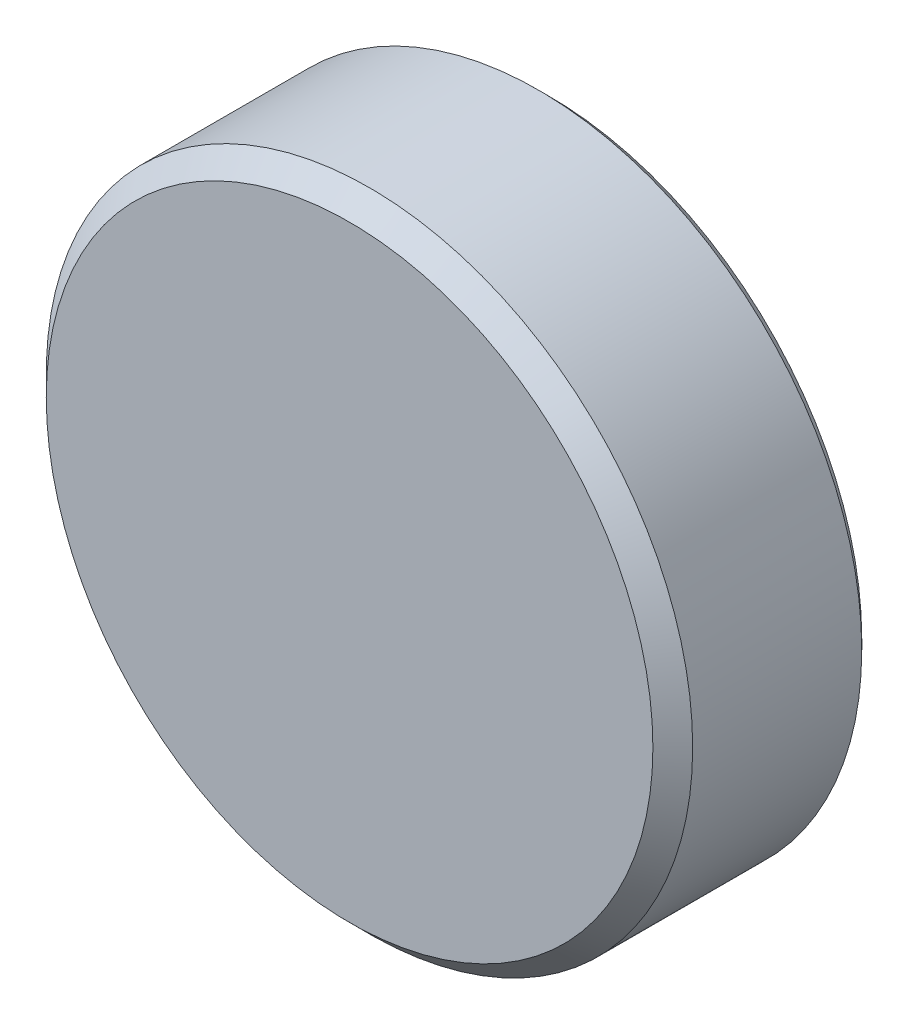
ISO-10303-21;
HEADER;
FILE_DESCRIPTION(('STEP AP214'),'2;1');
FILE_NAME('part.step','',(''),(''),'','','');
FILE_SCHEMA(('AUTOMOTIVE_DESIGN { 1 0 10303 214 1 1 1 1 }'));
ENDSEC;
DATA;
#1=APPLICATION_CONTEXT('core data for automotive mechanical design processes');
#2=APPLICATION_PROTOCOL_DEFINITION('international standard','automotive_design',2000,#1);
#3=PRODUCT_CONTEXT('',#1,'mechanical');
#4=PRODUCT('Part','Part','',(#3));
#5=PRODUCT_RELATED_PRODUCT_CATEGORY('part','',(#4));
#6=PRODUCT_DEFINITION_FORMATION('','',#4);
#7=PRODUCT_DEFINITION_CONTEXT('part definition',#1,'design');
#8=PRODUCT_DEFINITION('design','',#6,#7);
#9=PRODUCT_DEFINITION_SHAPE('','',#8);
#10=(LENGTH_UNIT() NAMED_UNIT(*) SI_UNIT(.MILLI.,.METRE.));
#11=(NAMED_UNIT(*) PLANE_ANGLE_UNIT() SI_UNIT($,.RADIAN.));
#12=(NAMED_UNIT(*) SI_UNIT($,.STERADIAN.) SOLID_ANGLE_UNIT());
#13=UNCERTAINTY_MEASURE_WITH_UNIT(LENGTH_MEASURE(1.E-05),#10,'distance_accuracy_value','');
#14=(GEOMETRIC_REPRESENTATION_CONTEXT(3) GLOBAL_UNCERTAINTY_ASSIGNED_CONTEXT((#13)) GLOBAL_UNIT_ASSIGNED_CONTEXT((#10,
#11,#12)) REPRESENTATION_CONTEXT('',''));
#15=CARTESIAN_POINT('',(0.,0.,0.));
#16=DIRECTION('',(0.,0.,1.));
#17=DIRECTION('',(1.,0.,0.));
#18=AXIS2_PLACEMENT_3D('',#15,#16,#17);
#19=CARTESIAN_POINT('',(0.,0.,25.4));
#20=DIRECTION('',(0.,0.,-1.));
#21=DIRECTION('',(-1.,0.,0.));
#22=AXIS2_PLACEMENT_3D('',#19,#20,#21);
#23=CYLINDRICAL_SURFACE('',#22,41.275);
#24=CARTESIAN_POINT('',(0.,0.,1.26999999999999));
#25=DIRECTION('',(0.,0.,1.));
#26=DIRECTION('',(1.,0.,0.));
#27=AXIS2_PLACEMENT_3D('',#24,#25,#26);
#28=CIRCLE('',#27,41.275);
#29=CARTESIAN_POINT('',(41.275,0.,1.26999999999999));
#30=VERTEX_POINT('',#29);
#31=EDGE_CURVE('E39',#30,#30,#28,.T.);
#32=ORIENTED_EDGE('',*,*,#31,.T.);
#33=EDGE_LOOP('',(#32));
#34=FACE_BOUND('',#33,.T.);
#35=CARTESIAN_POINT('',(0.,0.,22.86));
#36=DIRECTION('',(0.,0.,1.));
#37=DIRECTION('',(1.,0.,0.));
#38=AXIS2_PLACEMENT_3D('',#35,#36,#37);
#39=CIRCLE('',#38,41.275);
#40=CARTESIAN_POINT('',(41.275,0.,22.86));
#41=VERTEX_POINT('',#40);
#42=EDGE_CURVE('E43',#41,#41,#39,.F.);
#43=ORIENTED_EDGE('',*,*,#42,.T.);
#44=EDGE_LOOP('',(#43));
#45=FACE_BOUND('',#44,.T.);
#46=ADVANCED_FACE('F32',(#34,#45),#23,.T.);
#47=CARTESIAN_POINT('',(0.,0.,25.4));
#48=DIRECTION('',(0.,0.,1.));
#49=DIRECTION('',(1.,0.,0.));
#50=AXIS2_PLACEMENT_3D('',#47,#48,#49);
#51=PLANE('',#50);
#52=CARTESIAN_POINT('',(0.,0.,25.4));
#53=DIRECTION('',(0.,0.,1.));
#54=DIRECTION('',(1.,0.,0.));
#55=AXIS2_PLACEMENT_3D('',#52,#53,#54);
#56=CIRCLE('',#55,38.735);
#57=CARTESIAN_POINT('',(38.735,0.,25.4));
#58=VERTEX_POINT('',#57);
#59=EDGE_CURVE('E47',#58,#58,#56,.T.);
#60=ORIENTED_EDGE('',*,*,#59,.T.);
#61=EDGE_LOOP('',(#60));
#62=FACE_BOUND('',#61,.T.);
#63=ADVANCED_FACE('F53',(#62),#51,.T.);
#64=CARTESIAN_POINT('',(0.,0.,0.));
#65=DIRECTION('',(0.,0.,1.));
#66=DIRECTION('',(1.,0.,0.));
#67=AXIS2_PLACEMENT_3D('',#64,#65,#66);
#68=PLANE('',#67);
#69=CARTESIAN_POINT('',(0.,0.,0.));
#70=DIRECTION('',(0.,0.,1.));
#71=DIRECTION('',(1.,0.,0.));
#72=AXIS2_PLACEMENT_3D('',#69,#70,#71);
#73=CIRCLE('',#72,40.005);
#74=CARTESIAN_POINT('',(40.005,0.,0.));
#75=VERTEX_POINT('',#74);
#76=EDGE_CURVE('E10',#75,#75,#73,.F.);
#77=ORIENTED_EDGE('',*,*,#76,.T.);
#78=EDGE_LOOP('',(#77));
#79=FACE_BOUND('',#78,.T.);
#80=ADVANCED_FACE('F57',(#79),#68,.F.);
#81=CARTESIAN_POINT('',(0.,0.,25.4));
#82=DIRECTION('',(0.,0.,-1.));
#83=DIRECTION('',(-1.,0.,0.));
#84=AXIS2_PLACEMENT_3D('',#81,#82,#83);
#85=CONICAL_SURFACE('',#84,38.735,0.785398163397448);
#86=ORIENTED_EDGE('',*,*,#42,.F.);
#87=EDGE_LOOP('',(#86));
#88=FACE_BOUND('',#87,.T.);
#89=ORIENTED_EDGE('',*,*,#59,.F.);
#90=EDGE_LOOP('',(#89));
#91=FACE_BOUND('',#90,.T.);
#92=ADVANCED_FACE('F55',(#88,#91),#85,.T.);
#93=CARTESIAN_POINT('',(0.,0.,1.26999999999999));
#94=DIRECTION('',(0.,0.,1.));
#95=DIRECTION('',(1.,0.,0.));
#96=AXIS2_PLACEMENT_3D('',#93,#94,#95);
#97=CONICAL_SURFACE('',#96,41.275,0.785398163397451);
#98=ORIENTED_EDGE('',*,*,#76,.F.);
#99=EDGE_LOOP('',(#98));
#100=FACE_BOUND('',#99,.T.);
#101=ORIENTED_EDGE('',*,*,#31,.F.);
#102=EDGE_LOOP('',(#101));
#103=FACE_BOUND('',#102,.T.);
#104=ADVANCED_FACE('F34',(#100,#103),#97,.T.);
#105=CLOSED_SHELL('',(#46,#63,#80,#92,#104));
#106=MANIFOLD_SOLID_BREP('B2',#105);
#107=ADVANCED_BREP_SHAPE_REPRESENTATION('',(#18,#106),#14);
#108=SHAPE_DEFINITION_REPRESENTATION(#9,#107);
ENDSEC;
END-ISO-10303-21;
